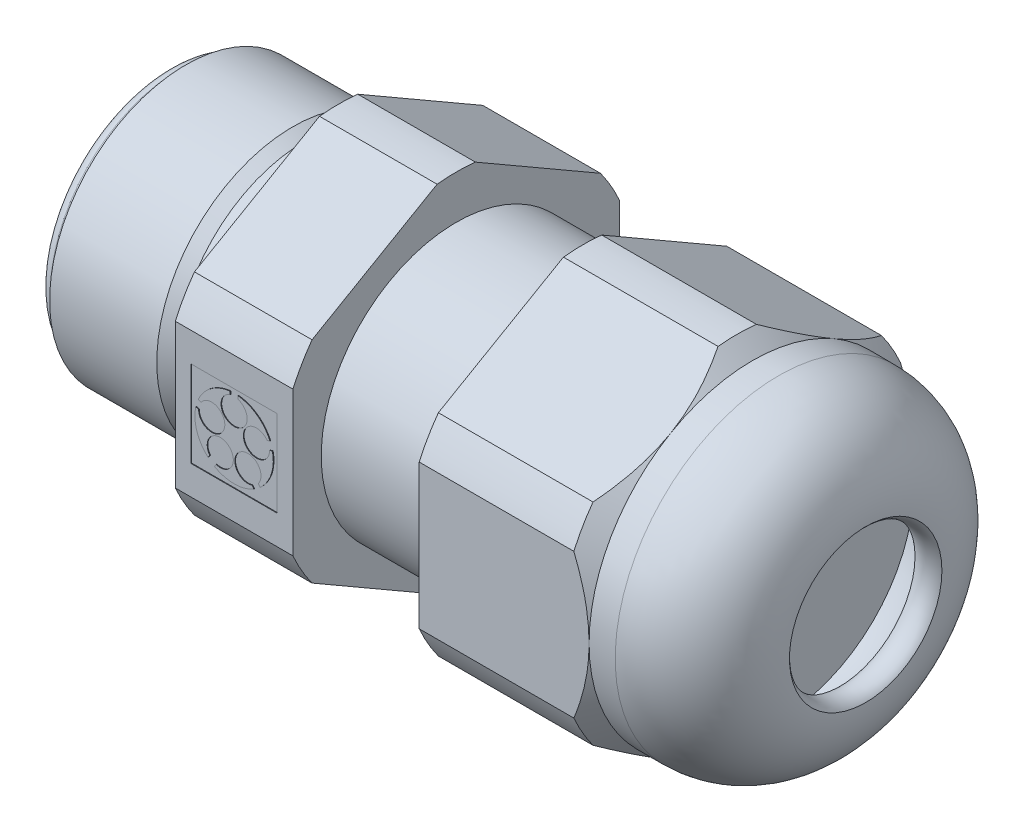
from build123d import *

# Parameters (mm, degrees)
ESQUISSE2_W             = 30
ESQUISSE2_H             = 30
ENL_V_MAT_EXTRU_1_DEPTH = 32
ESQUISSE3_W             = 3.96
ESQUISSE3_H             = 3.96
ENL_V_MAT_EXTRU_2_DEPTH = 0.03


with BuildPart() as part:
    # Esquisse1 → R_volution1 (revolve)
    with BuildSketch(Plane.XY, mode=Mode.PRIVATE) as r_volution1_sk:
        with BuildLine():
            Line((0, 5.4375), (0, 1.75))
            ThreePointArc((0, 1.75), (0.146446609, 1.396446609), (0.5, 1.25))
            Line((0.5, 1.25), (28, 1.25))
            Line((28, 1.25), (28, 6.2))
            ThreePointArc((28, 6.2), (29.872805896, 5.444890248), (30.698075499, 3.601924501))
            ThreePointArc((30.698075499, 3.601924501), (31.322674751, 3.21421659), (32, 3.5))
            ThreePointArc((32, 3.5), (30.828427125, 6.328427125), (28, 7.5))
            Line((28, 7.5), (26.8, 7.5))
            Line((26.8, 7.5), (24.3, 10))
            Line((24.3, 10), (19, 10))
            Line((19, 10), (19, 6.2))
            Line((19, 6.2), (13.2, 6.2))
            Line((13.2, 6.2), (13.2, 10))
            Line((13.2, 10), (7.8, 10))
            Line((7.8, 10), (7.8, 5.9375))
            Line((7.8, 5.9375), (6.24, 5.9375))
            Line((6.24, 5.9375), (5.698734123, 6.25))
            Line((5.698734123, 6.25), (0.78, 6.25))
            Line((0.78, 6.25), (0.78, 5.9375))
            Line((0.78, 5.9375), (0.5, 5.9375))
            ThreePointArc((0.5, 5.9375), (0.146446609, 5.791053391), (0, 5.4375))
        make_face()
    revolve(r_volution1_sk.sketch.rotate(Axis((32, 0, 0), (-1, 0, 0)), 90), axis=Axis((32, 0, 0), (-1, 0, 0)))

    # Esquisse2 → Enl_v. mat.-Extru.1 (cut)
    with BuildSketch(Plane(origin=(7.8, 0, 0), x_dir=(0, 0, -1), z_dir=(1, 0, 0))):
        Rectangle(ESQUISSE2_W, ESQUISSE2_H)
        with BuildLine():
            Line((-7.5, 3.315116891), (-7.5, -3.315116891))
            ThreePointArc((-7.5, -3.315116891), (-7.101408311, -4.1), (-6.620975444, -4.837632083))
            Line((-6.620975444, -4.837632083), (-0.879024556, -8.152748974))
            ThreePointArc((-0.879024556, -8.152748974), (0, -8.2), (0.879024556, -8.152748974))
            Line((0.879024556, -8.152748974), (6.620975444, -4.837632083))
            ThreePointArc((6.620975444, -4.837632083), (7.101408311, -4.1), (7.5, -3.315116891))
            Line((7.5, -3.315116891), (7.5, 3.315116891))
            ThreePointArc((7.5, 3.315116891), (7.101408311, 4.1), (6.620975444, 4.837632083))
            Line((6.620975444, 4.837632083), (0.879024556, 8.152748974))
            ThreePointArc((0.879024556, 8.152748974), (0, 8.2), (-0.879024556, 8.152748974))
            Line((-0.879024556, 8.152748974), (-6.620975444, 4.837632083))
            ThreePointArc((-6.620975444, 4.837632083), (-7.101408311, 4.1), (-7.5, 3.315116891))
        make_face(mode=Mode.SUBTRACT)
    extrude(amount=ENL_V_MAT_EXTRU_1_DEPTH, mode=Mode.SUBTRACT)

    # Esquisse3 → Enl_v. mat.-Extru.2 (cut)
    with BuildSketch(Plane.XY.offset(7.5)):
        with Locations((10.5, 0)):
            Rectangle(ESQUISSE3_W, ESQUISSE3_H)
        with BuildLine():
            Line((9.301666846, -1.343129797), (9.383142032, -1.230988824))
            ThreePointArc((9.383142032, -1.230988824), (10.217863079, -0.388328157), (9.67438815, -1.442591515))
            Line((9.67438815, -1.442591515), (9.592912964, -1.554732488))
            ThreePointArc((9.592912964, -1.554732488), (10.5, -1.8), (11.407087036, -1.554732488))
            Line((11.407087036, -1.554732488), (11.32561185, -1.442591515))
            ThreePointArc((11.32561185, -1.442591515), (10.782136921, -0.388328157), (11.616857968, -1.230988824))
            Line((11.616857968, -1.230988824), (11.698333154, -1.343129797))
            ThreePointArc((11.698333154, -1.343129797), (12.211901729, -0.55623059), (12.258943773, 0.382252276))
            Line((12.258943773, 0.382252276), (12.127114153, 0.339418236))
            ThreePointArc((12.127114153, 0.339418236), (10.956507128, 0.148328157), (12.015868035, 0.681798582))
            Line((12.015868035, 0.681798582), (12.147697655, 0.724632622))
            ThreePointArc((12.147697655, 0.724632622), (11.558013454, 1.45623059), (10.68, 1.790977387))
            Line((10.68, 1.790977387), (10.68, 1.652363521))
            ThreePointArc((10.68, 1.652363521), (10.5, 0.48), (10.32, 1.652363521))
            Line((10.32, 1.652363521), (10.32, 1.790977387))
            ThreePointArc((10.32, 1.790977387), (9.441986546, 1.45623059), (8.852302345, 0.724632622))
            Line((8.852302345, 0.724632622), (8.984131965, 0.681798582))
            ThreePointArc((8.984131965, 0.681798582), (10.043492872, 0.148328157), (8.872885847, 0.339418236))
            Line((8.872885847, 0.339418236), (8.741056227, 0.382252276))
            ThreePointArc((8.741056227, 0.382252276), (8.788098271, -0.55623059), (9.301666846, -1.343129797))
        make_face(mode=Mode.SUBTRACT)
    extrude(amount=-ENL_V_MAT_EXTRU_2_DEPTH, mode=Mode.SUBTRACT)


solid = part.part
